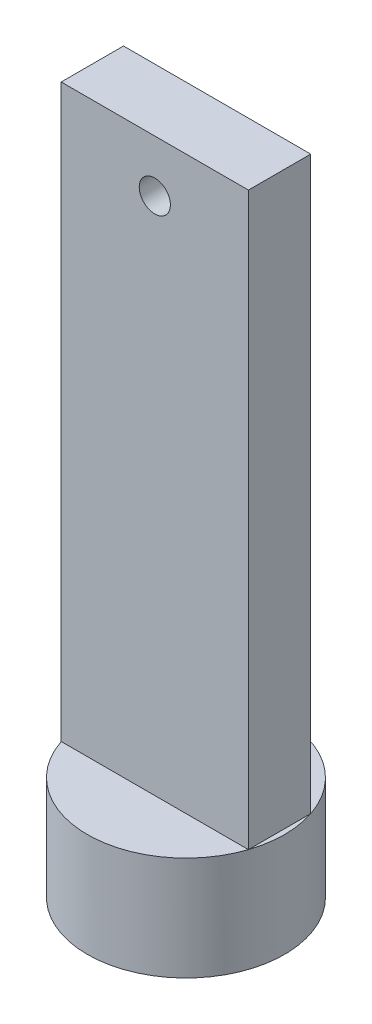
from build123d import *

# Parameters (mm, degrees)
SKETCH1_R           = 475
SKETCH1_R_2         = 45.513451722
BOSS_EXTRUDE1_DEPTH = 500
SKETCH2_W           = 901.387818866
SKETCH2_H           = 300
BOSS_EXTRUDE2_DEPTH = 2750
SKETCH3_R           = 75
CUT_EXTRUDE1_DEPTH  = 1500


with BuildPart() as part:
    # Sketch1 → Boss-Extrude1 (new body)
    with BuildSketch(Plane(origin=(0, 0, 0), x_dir=(1, 0, 0), z_dir=(0, 1, 0))):
        with Locations(Location((0, 0, 0), (0, 0, 270))):
            Circle(SKETCH1_R)
        with Locations(Location((0, 0, 0), (0, 0, 270))):
            Circle(SKETCH1_R_2, mode=Mode.SUBTRACT)
    extrude(amount=BOSS_EXTRUDE1_DEPTH)

    # Sketch2 → Boss-Extrude2 (add)
    with BuildSketch(Plane(origin=(0, 500, 0), x_dir=(1, 0, 0), z_dir=(0, 1, 0))):
        Rectangle(SKETCH2_W, SKETCH2_H)
    extrude(amount=BOSS_EXTRUDE2_DEPTH)

    # Sketch3 → Cut-Extrude1 (cut, symmetric)
    with BuildSketch(Plane.XY):
        with Locations((0, 3000)):
            Circle(SKETCH3_R)
    extrude(amount=CUT_EXTRUDE1_DEPTH, both=True, mode=Mode.SUBTRACT)


solid = part.part
